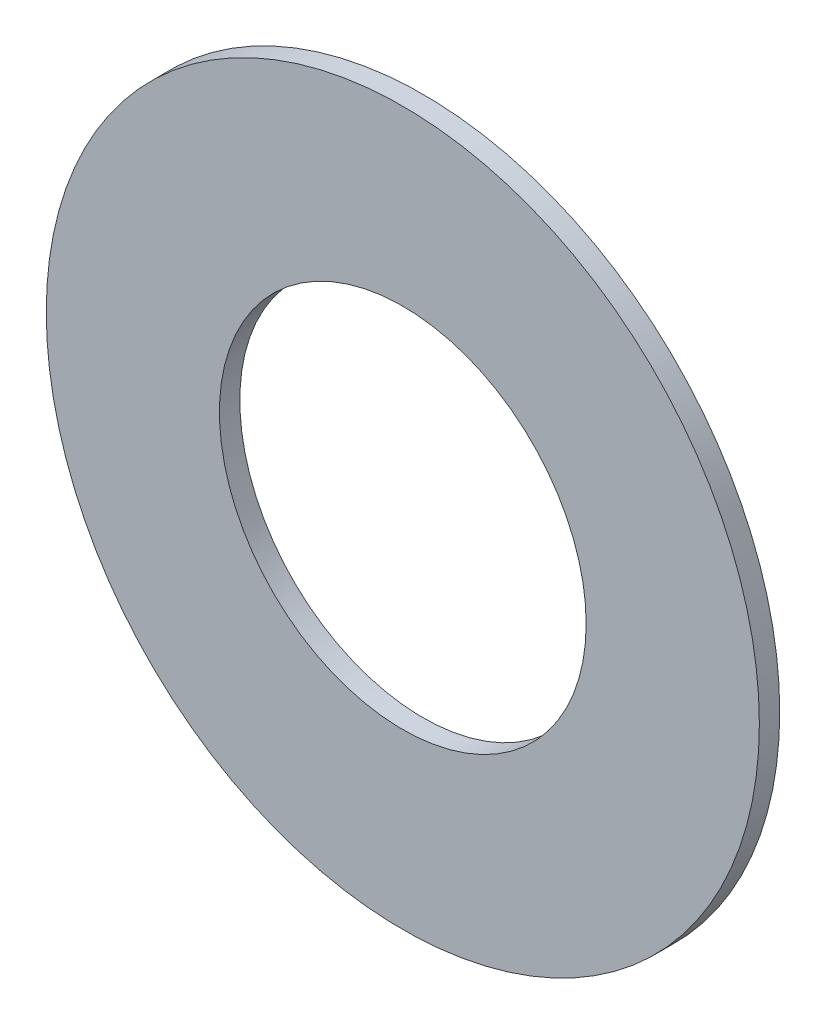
from build123d import *

# Parameters (mm, degrees)
SKETCH1_R      = 35
SKETCH1_R_2    = 18
EXTRUDE1_DEPTH = 2


with BuildPart() as part:
    # Sketch1 → Extrude1 (new body)
    with BuildSketch(Plane.XY):
        Circle(SKETCH1_R)
        Circle(SKETCH1_R_2, mode=Mode.SUBTRACT)
    extrude(amount=EXTRUDE1_DEPTH)


solid = part.part
